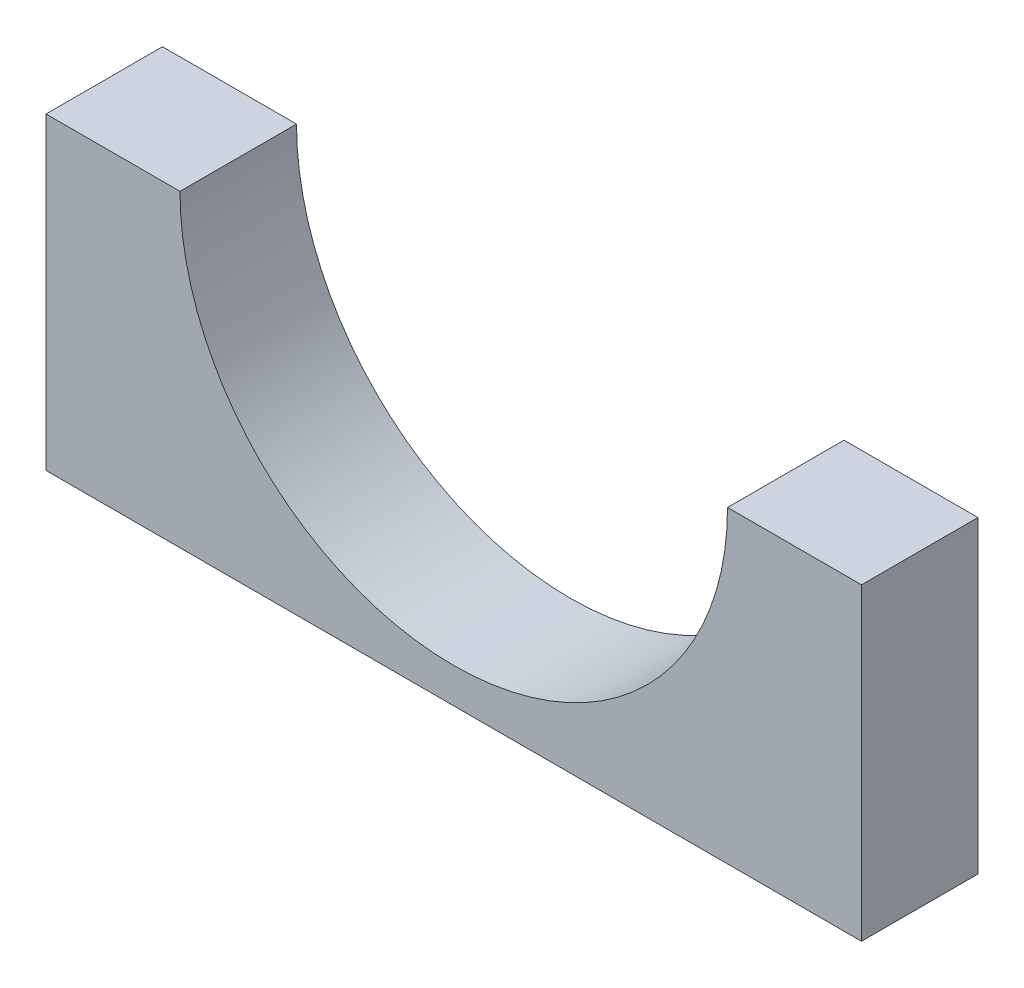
ISO-10303-21;
HEADER;
FILE_DESCRIPTION(('STEP AP214'),'2;1');
FILE_NAME('part.step','',(''),(''),'','','');
FILE_SCHEMA(('AUTOMOTIVE_DESIGN { 1 0 10303 214 1 1 1 1 }'));
ENDSEC;
DATA;
#1=APPLICATION_CONTEXT('core data for automotive mechanical design processes');
#2=APPLICATION_PROTOCOL_DEFINITION('international standard','automotive_design',2000,#1);
#3=PRODUCT_CONTEXT('',#1,'mechanical');
#4=PRODUCT('Part','Part','',(#3));
#5=PRODUCT_RELATED_PRODUCT_CATEGORY('part','',(#4));
#6=PRODUCT_DEFINITION_FORMATION('','',#4);
#7=PRODUCT_DEFINITION_CONTEXT('part definition',#1,'design');
#8=PRODUCT_DEFINITION('design','',#6,#7);
#9=PRODUCT_DEFINITION_SHAPE('','',#8);
#10=(LENGTH_UNIT() NAMED_UNIT(*) SI_UNIT(.MILLI.,.METRE.));
#11=(NAMED_UNIT(*) PLANE_ANGLE_UNIT() SI_UNIT($,.RADIAN.));
#12=(NAMED_UNIT(*) SI_UNIT($,.STERADIAN.) SOLID_ANGLE_UNIT());
#13=UNCERTAINTY_MEASURE_WITH_UNIT(LENGTH_MEASURE(1.E-05),#10,'distance_accuracy_value','');
#14=(GEOMETRIC_REPRESENTATION_CONTEXT(3) GLOBAL_UNCERTAINTY_ASSIGNED_CONTEXT((#13)) GLOBAL_UNIT_ASSIGNED_CONTEXT((#10,
#11,#12)) REPRESENTATION_CONTEXT('',''));
#15=CARTESIAN_POINT('',(0.,0.,0.));
#16=DIRECTION('',(0.,0.,1.));
#17=DIRECTION('',(1.,0.,0.));
#18=AXIS2_PLACEMENT_3D('',#15,#16,#17);
#19=CARTESIAN_POINT('',(-74.,-25.,-84.8481796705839));
#20=DIRECTION('',(0.,0.,1.));
#21=DIRECTION('',(1.,0.,0.));
#22=AXIS2_PLACEMENT_3D('',#19,#20,#21);
#23=CYLINDRICAL_SURFACE('',#22,23.5);
#24=CARTESIAN_POINT('',(-74.,-25.,-9.99999999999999));
#25=DIRECTION('',(0.,0.,1.));
#26=DIRECTION('',(1.,0.,0.));
#27=AXIS2_PLACEMENT_3D('',#24,#25,#26);
#28=CIRCLE('',#27,23.5);
#29=CARTESIAN_POINT('',(-97.5,-25.,-9.99999999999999));
#30=VERTEX_POINT('',#29);
#31=CARTESIAN_POINT('',(-50.5,-25.,-9.99999999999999));
#32=VERTEX_POINT('',#31);
#33=EDGE_CURVE('E37',#30,#32,#28,.T.);
#34=ORIENTED_EDGE('',*,*,#33,.F.);
#35=DIRECTION('',(0.,0.,1.));
#36=VECTOR('',#35,1.);
#37=CARTESIAN_POINT('',(-97.5,-25.,-84.8481796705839));
#38=LINE('',#37,#36);
#39=CARTESIAN_POINT('',(-97.5,-25.,0.));
#40=VERTEX_POINT('',#39);
#41=EDGE_CURVE('E93',#30,#40,#38,.T.);
#42=ORIENTED_EDGE('',*,*,#41,.T.);
#43=CARTESIAN_POINT('',(-74.,-25.,0.));
#44=DIRECTION('',(0.,0.,-1.));
#45=DIRECTION('',(-1.,0.,0.));
#46=AXIS2_PLACEMENT_3D('',#43,#44,#45);
#47=CIRCLE('',#46,23.5);
#48=CARTESIAN_POINT('',(-50.5,-25.,0.));
#49=VERTEX_POINT('',#48);
#50=EDGE_CURVE('E118',#49,#40,#47,.T.);
#51=ORIENTED_EDGE('',*,*,#50,.F.);
#52=DIRECTION('',(0.,0.,1.));
#53=VECTOR('',#52,1.);
#54=CARTESIAN_POINT('',(-50.5,-25.,-84.8481796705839));
#55=LINE('',#54,#53);
#56=EDGE_CURVE('E86',#32,#49,#55,.T.);
#57=ORIENTED_EDGE('',*,*,#56,.F.);
#58=EDGE_LOOP('',(#34,#42,#51,#57));
#59=FACE_BOUND('',#58,.T.);
#60=ADVANCED_FACE('F29',(#59),#23,.F.);
#61=CARTESIAN_POINT('',(-50.5,-25.,-84.8481796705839));
#62=DIRECTION('',(0.,1.,0.));
#63=DIRECTION('',(-1.,0.,0.));
#64=AXIS2_PLACEMENT_3D('',#61,#62,#63);
#65=PLANE('',#64);
#66=DIRECTION('',(1.,0.,0.));
#67=VECTOR('',#66,1.);
#68=CARTESIAN_POINT('',(-50.5,-25.,-9.99999999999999));
#69=LINE('',#68,#67);
#70=CARTESIAN_POINT('',(-39.,-25.,-9.99999999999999));
#71=VERTEX_POINT('',#70);
#72=EDGE_CURVE('E62',#32,#71,#69,.T.);
#73=ORIENTED_EDGE('',*,*,#72,.F.);
#74=ORIENTED_EDGE('',*,*,#56,.T.);
#75=DIRECTION('',(-1.,0.,0.));
#76=VECTOR('',#75,1.);
#77=CARTESIAN_POINT('',(-50.5,-25.,0.));
#78=LINE('',#77,#76);
#79=CARTESIAN_POINT('',(-39.,-25.,0.));
#80=VERTEX_POINT('',#79);
#81=EDGE_CURVE('E95',#80,#49,#78,.T.);
#82=ORIENTED_EDGE('',*,*,#81,.F.);
#83=DIRECTION('',(0.,0.,1.));
#84=VECTOR('',#83,1.);
#85=CARTESIAN_POINT('',(-39.,-25.,-84.8481796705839));
#86=LINE('',#85,#84);
#87=EDGE_CURVE('E84',#71,#80,#86,.T.);
#88=ORIENTED_EDGE('',*,*,#87,.F.);
#89=EDGE_LOOP('',(#73,#74,#82,#88));
#90=FACE_BOUND('',#89,.T.);
#91=ADVANCED_FACE('F136',(#90),#65,.T.);
#92=CARTESIAN_POINT('',(-39.,-25.,-84.8481796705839));
#93=DIRECTION('',(1.,0.,0.));
#94=DIRECTION('',(0.,1.,0.));
#95=AXIS2_PLACEMENT_3D('',#92,#93,#94);
#96=PLANE('',#95);
#97=DIRECTION('',(0.,-1.,0.));
#98=VECTOR('',#97,1.);
#99=CARTESIAN_POINT('',(-39.,-25.,-9.99999999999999));
#100=LINE('',#99,#98);
#101=CARTESIAN_POINT('',(-39.,-51.5,-9.99999999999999));
#102=VERTEX_POINT('',#101);
#103=EDGE_CURVE('E56',#71,#102,#100,.T.);
#104=ORIENTED_EDGE('',*,*,#103,.F.);
#105=ORIENTED_EDGE('',*,*,#87,.T.);
#106=DIRECTION('',(0.,1.,0.));
#107=VECTOR('',#106,1.);
#108=CARTESIAN_POINT('',(-39.,-25.,0.));
#109=LINE('',#108,#107);
#110=CARTESIAN_POINT('',(-39.,-51.5,0.));
#111=VERTEX_POINT('',#110);
#112=EDGE_CURVE('E82',#111,#80,#109,.T.);
#113=ORIENTED_EDGE('',*,*,#112,.F.);
#114=DIRECTION('',(0.,0.,1.));
#115=VECTOR('',#114,1.);
#116=CARTESIAN_POINT('',(-39.,-51.5,-84.8481796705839));
#117=LINE('',#116,#115);
#118=EDGE_CURVE('E74',#102,#111,#117,.T.);
#119=ORIENTED_EDGE('',*,*,#118,.F.);
#120=EDGE_LOOP('',(#104,#105,#113,#119));
#121=FACE_BOUND('',#120,.T.);
#122=ADVANCED_FACE('F80',(#121),#96,.T.);
#123=CARTESIAN_POINT('',(-39.,-51.5,-84.8481796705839));
#124=DIRECTION('',(0.,-1.,0.));
#125=DIRECTION('',(0.,0.,-1.));
#126=AXIS2_PLACEMENT_3D('',#123,#124,#125);
#127=PLANE('',#126);
#128=DIRECTION('',(-1.,0.,0.));
#129=VECTOR('',#128,1.);
#130=CARTESIAN_POINT('',(-39.,-51.5,-9.99999999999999));
#131=LINE('',#130,#129);
#132=CARTESIAN_POINT('',(-109.,-51.5,-9.99999999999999));
#133=VERTEX_POINT('',#132);
#134=EDGE_CURVE('E59',#102,#133,#131,.T.);
#135=ORIENTED_EDGE('',*,*,#134,.F.);
#136=ORIENTED_EDGE('',*,*,#118,.T.);
#137=DIRECTION('',(1.,0.,0.));
#138=VECTOR('',#137,1.);
#139=CARTESIAN_POINT('',(-39.,-51.5,0.));
#140=LINE('',#139,#138);
#141=CARTESIAN_POINT('',(-109.,-51.5,0.));
#142=VERTEX_POINT('',#141);
#143=EDGE_CURVE('E107',#142,#111,#140,.T.);
#144=ORIENTED_EDGE('',*,*,#143,.F.);
#145=DIRECTION('',(0.,0.,1.));
#146=VECTOR('',#145,1.);
#147=CARTESIAN_POINT('',(-109.,-51.5,-84.8481796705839));
#148=LINE('',#147,#146);
#149=EDGE_CURVE('E77',#133,#142,#148,.T.);
#150=ORIENTED_EDGE('',*,*,#149,.F.);
#151=EDGE_LOOP('',(#135,#136,#144,#150));
#152=FACE_BOUND('',#151,.T.);
#153=ADVANCED_FACE('F71',(#152),#127,.T.);
#154=CARTESIAN_POINT('',(-109.,-51.5,-84.8481796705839));
#155=DIRECTION('',(-1.,0.,0.));
#156=DIRECTION('',(0.,-1.,0.));
#157=AXIS2_PLACEMENT_3D('',#154,#155,#156);
#158=PLANE('',#157);
#159=DIRECTION('',(0.,1.,0.));
#160=VECTOR('',#159,1.);
#161=CARTESIAN_POINT('',(-109.,-51.5,-9.99999999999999));
#162=LINE('',#161,#160);
#163=CARTESIAN_POINT('',(-109.,-25.,-10.));
#164=VERTEX_POINT('',#163);
#165=EDGE_CURVE('E78',#133,#164,#162,.T.);
#166=ORIENTED_EDGE('',*,*,#165,.F.);
#167=ORIENTED_EDGE('',*,*,#149,.T.);
#168=DIRECTION('',(0.,-1.,0.));
#169=VECTOR('',#168,1.);
#170=CARTESIAN_POINT('',(-109.,-51.5,0.));
#171=LINE('',#170,#169);
#172=CARTESIAN_POINT('',(-109.,-25.,0.));
#173=VERTEX_POINT('',#172);
#174=EDGE_CURVE('E123',#173,#142,#171,.T.);
#175=ORIENTED_EDGE('',*,*,#174,.F.);
#176=DIRECTION('',(0.,0.,1.));
#177=VECTOR('',#176,1.);
#178=CARTESIAN_POINT('',(-109.,-25.,-84.8481796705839));
#179=LINE('',#178,#177);
#180=EDGE_CURVE('E88',#164,#173,#179,.T.);
#181=ORIENTED_EDGE('',*,*,#180,.F.);
#182=EDGE_LOOP('',(#166,#167,#175,#181));
#183=FACE_BOUND('',#182,.T.);
#184=ADVANCED_FACE('F139',(#183),#158,.T.);
#185=CARTESIAN_POINT('',(-109.,-25.,-84.8481796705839));
#186=DIRECTION('',(0.,1.,0.));
#187=DIRECTION('',(0.,0.,1.));
#188=AXIS2_PLACEMENT_3D('',#185,#186,#187);
#189=PLANE('',#188);
#190=DIRECTION('',(1.,0.,0.));
#191=VECTOR('',#190,1.);
#192=CARTESIAN_POINT('',(-109.,-25.,-9.99999999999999));
#193=LINE('',#192,#191);
#194=EDGE_CURVE('E11',#164,#30,#193,.T.);
#195=ORIENTED_EDGE('',*,*,#194,.F.);
#196=ORIENTED_EDGE('',*,*,#180,.T.);
#197=DIRECTION('',(-1.,0.,0.));
#198=VECTOR('',#197,1.);
#199=CARTESIAN_POINT('',(-109.,-25.,0.));
#200=LINE('',#199,#198);
#201=EDGE_CURVE('E120',#40,#173,#200,.T.);
#202=ORIENTED_EDGE('',*,*,#201,.F.);
#203=ORIENTED_EDGE('',*,*,#41,.F.);
#204=EDGE_LOOP('',(#195,#196,#202,#203));
#205=FACE_BOUND('',#204,.T.);
#206=ADVANCED_FACE('F138',(#205),#189,.T.);
#207=CARTESIAN_POINT('',(-74.,-25.,0.));
#208=DIRECTION('',(0.,0.,-1.));
#209=DIRECTION('',(-1.,0.,0.));
#210=AXIS2_PLACEMENT_3D('',#207,#208,#209);
#211=PLANE('',#210);
#212=ORIENTED_EDGE('',*,*,#50,.T.);
#213=ORIENTED_EDGE('',*,*,#201,.T.);
#214=ORIENTED_EDGE('',*,*,#174,.T.);
#215=ORIENTED_EDGE('',*,*,#143,.T.);
#216=ORIENTED_EDGE('',*,*,#112,.T.);
#217=ORIENTED_EDGE('',*,*,#81,.T.);
#218=EDGE_LOOP('',(#212,#213,#214,#215,#216,#217));
#219=FACE_BOUND('',#218,.T.);
#220=ADVANCED_FACE('F125',(#219),#211,.F.);
#221=CARTESIAN_POINT('',(-109.,-95.7106781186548,-9.99999999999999));
#222=DIRECTION('',(0.,0.,1.));
#223=DIRECTION('',(1.,0.,0.));
#224=AXIS2_PLACEMENT_3D('',#221,#222,#223);
#225=PLANE('',#224);
#226=ORIENTED_EDGE('',*,*,#33,.T.);
#227=ORIENTED_EDGE('',*,*,#72,.T.);
#228=ORIENTED_EDGE('',*,*,#103,.T.);
#229=ORIENTED_EDGE('',*,*,#134,.T.);
#230=ORIENTED_EDGE('',*,*,#165,.T.);
#231=ORIENTED_EDGE('',*,*,#194,.T.);
#232=EDGE_LOOP('',(#226,#227,#228,#229,#230,#231));
#233=FACE_BOUND('',#232,.T.);
#234=ADVANCED_FACE('F58',(#233),#225,.F.);
#235=CLOSED_SHELL('',(#60,#91,#122,#153,#184,#206,#220,#234));
#236=MANIFOLD_SOLID_BREP('B2',#235);
#237=ADVANCED_BREP_SHAPE_REPRESENTATION('',(#18,#236),#14);
#238=SHAPE_DEFINITION_REPRESENTATION(#9,#237);
ENDSEC;
END-ISO-10303-21;
